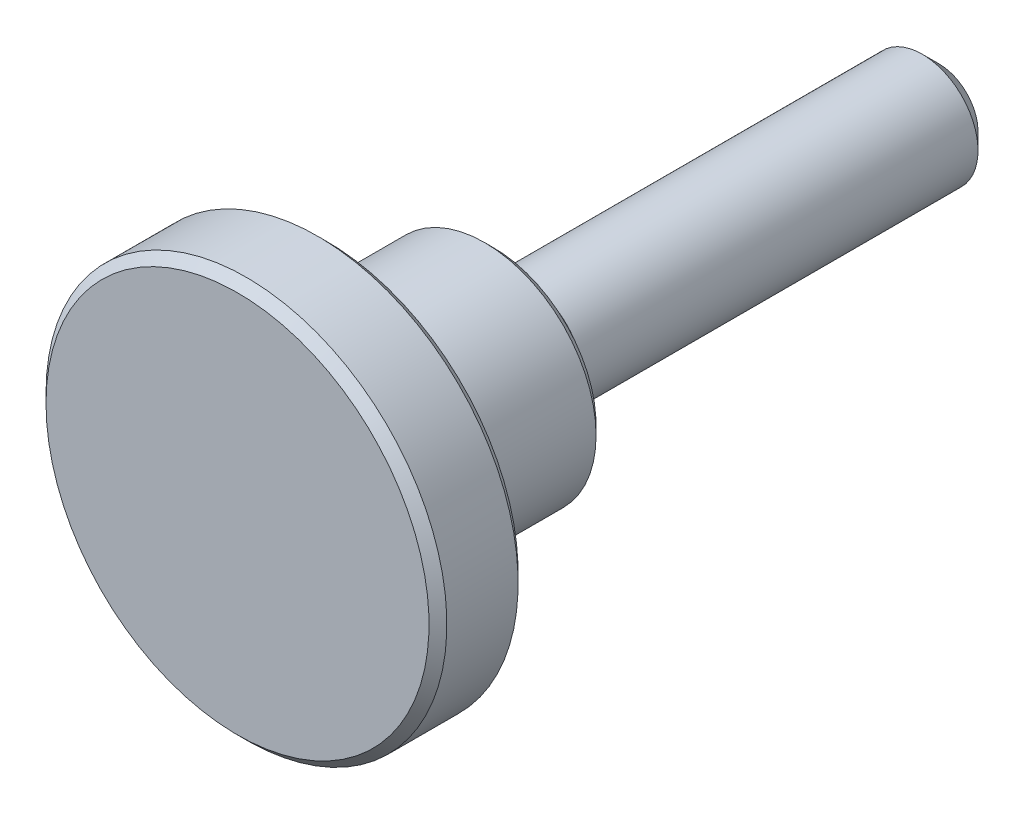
ISO-10303-21;
HEADER;
FILE_DESCRIPTION(('STEP AP214'),'2;1');
FILE_NAME('part.step','',(''),(''),'','','');
FILE_SCHEMA(('AUTOMOTIVE_DESIGN { 1 0 10303 214 1 1 1 1 }'));
ENDSEC;
DATA;
#1=APPLICATION_CONTEXT('core data for automotive mechanical design processes');
#2=APPLICATION_PROTOCOL_DEFINITION('international standard','automotive_design',2000,#1);
#3=PRODUCT_CONTEXT('',#1,'mechanical');
#4=PRODUCT('Part','Part','',(#3));
#5=PRODUCT_RELATED_PRODUCT_CATEGORY('part','',(#4));
#6=PRODUCT_DEFINITION_FORMATION('','',#4);
#7=PRODUCT_DEFINITION_CONTEXT('part definition',#1,'design');
#8=PRODUCT_DEFINITION('design','',#6,#7);
#9=PRODUCT_DEFINITION_SHAPE('','',#8);
#10=(LENGTH_UNIT() NAMED_UNIT(*) SI_UNIT(.MILLI.,.METRE.));
#11=(NAMED_UNIT(*) PLANE_ANGLE_UNIT() SI_UNIT($,.RADIAN.));
#12=(NAMED_UNIT(*) SI_UNIT($,.STERADIAN.) SOLID_ANGLE_UNIT());
#13=UNCERTAINTY_MEASURE_WITH_UNIT(LENGTH_MEASURE(1.E-05),#10,'distance_accuracy_value','');
#14=(GEOMETRIC_REPRESENTATION_CONTEXT(3) GLOBAL_UNCERTAINTY_ASSIGNED_CONTEXT((#13)) GLOBAL_UNIT_ASSIGNED_CONTEXT((#10,
#11,#12)) REPRESENTATION_CONTEXT('',''));
#15=CARTESIAN_POINT('',(0.,0.,0.));
#16=DIRECTION('',(0.,0.,1.));
#17=DIRECTION('',(1.,0.,0.));
#18=AXIS2_PLACEMENT_3D('',#15,#16,#17);
#19=CARTESIAN_POINT('',(0.,0.,-40.));
#20=DIRECTION('',(0.,0.,-1.));
#21=DIRECTION('',(-1.,0.,0.));
#22=AXIS2_PLACEMENT_3D('',#19,#20,#21);
#23=CYLINDRICAL_SURFACE('',#22,5.);
#24=CARTESIAN_POINT('',(0.,0.,-38.5));
#25=DIRECTION('',(0.,0.,-1.));
#26=DIRECTION('',(-1.,0.,0.));
#27=AXIS2_PLACEMENT_3D('',#24,#25,#26);
#28=CIRCLE('',#27,5.);
#29=CARTESIAN_POINT('',(-5.,0.,-38.5));
#30=VERTEX_POINT('',#29);
#31=EDGE_CURVE('E8',#30,#30,#28,.F.);
#32=ORIENTED_EDGE('',*,*,#31,.T.);
#33=EDGE_LOOP('',(#32));
#34=FACE_BOUND('',#33,.T.);
#35=CARTESIAN_POINT('',(0.,0.,-3.));
#36=DIRECTION('',(0.,0.,-1.));
#37=DIRECTION('',(-1.,0.,0.));
#38=AXIS2_PLACEMENT_3D('',#35,#36,#37);
#39=CIRCLE('',#38,5.);
#40=CARTESIAN_POINT('',(-5.,0.,-3.));
#41=VERTEX_POINT('',#40);
#42=EDGE_CURVE('E23',#41,#41,#39,.T.);
#43=ORIENTED_EDGE('',*,*,#42,.T.);
#44=EDGE_LOOP('',(#43));
#45=FACE_BOUND('',#44,.T.);
#46=ADVANCED_FACE('F12',(#34,#45),#23,.T.);
#47=CARTESIAN_POINT('',(0.,5.,-3.));
#48=DIRECTION('',(0.,0.,1.));
#49=DIRECTION('',(1.,0.,0.));
#50=AXIS2_PLACEMENT_3D('',#47,#48,#49);
#51=PLANE('',#50);
#52=CARTESIAN_POINT('',(0.,0.,-3.));
#53=DIRECTION('',(0.,0.,-1.));
#54=DIRECTION('',(-1.,0.,0.));
#55=AXIS2_PLACEMENT_3D('',#52,#53,#54);
#56=CIRCLE('',#55,4.65);
#57=CARTESIAN_POINT('',(-4.65,0.,-3.));
#58=VERTEX_POINT('',#57);
#59=EDGE_CURVE('E27',#58,#58,#56,.T.);
#60=ORIENTED_EDGE('',*,*,#59,.T.);
#61=EDGE_LOOP('',(#60));
#62=FACE_BOUND('',#61,.T.);
#63=ORIENTED_EDGE('',*,*,#42,.F.);
#64=EDGE_LOOP('',(#63));
#65=FACE_BOUND('',#64,.T.);
#66=ADVANCED_FACE('F83',(#62,#65),#51,.T.);
#67=CARTESIAN_POINT('',(0.,0.,-2.2));
#68=DIRECTION('',(0.,0.,-1.));
#69=DIRECTION('',(-1.,0.,0.));
#70=AXIS2_PLACEMENT_3D('',#67,#68,#69);
#71=TOROIDAL_SURFACE('',#70,4.65,0.8);
#72=CARTESIAN_POINT('',(0.,0.,-2.2));
#73=DIRECTION('',(0.,0.,-1.));
#74=DIRECTION('',(-1.,0.,0.));
#75=AXIS2_PLACEMENT_3D('',#72,#73,#74);
#76=CIRCLE('',#75,3.85);
#77=CARTESIAN_POINT('',(-3.85,0.,-2.2));
#78=VERTEX_POINT('',#77);
#79=EDGE_CURVE('E32',#78,#78,#76,.T.);
#80=ORIENTED_EDGE('',*,*,#79,.T.);
#81=EDGE_LOOP('',(#80));
#82=FACE_BOUND('',#81,.T.);
#83=ORIENTED_EDGE('',*,*,#59,.F.);
#84=EDGE_LOOP('',(#83));
#85=FACE_BOUND('',#84,.T.);
#86=ADVANCED_FACE('F88',(#82,#85),#71,.F.);
#87=CARTESIAN_POINT('',(0.,0.,-40.));
#88=DIRECTION('',(0.,0.,-1.));
#89=DIRECTION('',(-1.,0.,0.));
#90=AXIS2_PLACEMENT_3D('',#87,#88,#89);
#91=CYLINDRICAL_SURFACE('',#90,3.85);
#92=CARTESIAN_POINT('',(0.,0.,-0.800000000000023));
#93=DIRECTION('',(0.,0.,-1.));
#94=DIRECTION('',(-1.,0.,0.));
#95=AXIS2_PLACEMENT_3D('',#92,#93,#94);
#96=CIRCLE('',#95,3.85);
#97=CARTESIAN_POINT('',(-3.85,0.,-0.800000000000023));
#98=VERTEX_POINT('',#97);
#99=EDGE_CURVE('E35',#98,#98,#96,.T.);
#100=ORIENTED_EDGE('',*,*,#99,.T.);
#101=EDGE_LOOP('',(#100));
#102=FACE_BOUND('',#101,.T.);
#103=ORIENTED_EDGE('',*,*,#79,.F.);
#104=EDGE_LOOP('',(#103));
#105=FACE_BOUND('',#104,.T.);
#106=ADVANCED_FACE('F95',(#102,#105),#91,.T.);
#107=CARTESIAN_POINT('',(0.,0.,-0.800000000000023));
#108=DIRECTION('',(0.,0.,-1.));
#109=DIRECTION('',(-1.,0.,0.));
#110=AXIS2_PLACEMENT_3D('',#107,#108,#109);
#111=TOROIDAL_SURFACE('',#110,4.65,0.800000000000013);
#112=CARTESIAN_POINT('',(0.,0.,0.));
#113=DIRECTION('',(0.,0.,-1.));
#114=DIRECTION('',(-1.,0.,0.));
#115=AXIS2_PLACEMENT_3D('',#112,#113,#114);
#116=CIRCLE('',#115,4.65000000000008);
#117=CARTESIAN_POINT('',(-4.65000000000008,0.,0.));
#118=VERTEX_POINT('',#117);
#119=EDGE_CURVE('E38',#118,#118,#116,.T.);
#120=ORIENTED_EDGE('',*,*,#119,.T.);
#121=EDGE_LOOP('',(#120));
#122=FACE_BOUND('',#121,.T.);
#123=ORIENTED_EDGE('',*,*,#99,.F.);
#124=EDGE_LOOP('',(#123));
#125=FACE_BOUND('',#124,.T.);
#126=ADVANCED_FACE('F99',(#122,#125),#111,.F.);
#127=CARTESIAN_POINT('',(0.,9.2,0.));
#128=DIRECTION('',(0.,0.,-1.));
#129=DIRECTION('',(-1.,0.,0.));
#130=AXIS2_PLACEMENT_3D('',#127,#128,#129);
#131=PLANE('',#130);
#132=CARTESIAN_POINT('',(0.,0.,0.));
#133=DIRECTION('',(0.,0.,-1.));
#134=DIRECTION('',(-1.,0.,0.));
#135=AXIS2_PLACEMENT_3D('',#132,#133,#134);
#136=CIRCLE('',#135,9.2);
#137=CARTESIAN_POINT('',(-9.2,0.,0.));
#138=VERTEX_POINT('',#137);
#139=EDGE_CURVE('E41',#138,#138,#136,.T.);
#140=ORIENTED_EDGE('',*,*,#139,.T.);
#141=EDGE_LOOP('',(#140));
#142=FACE_BOUND('',#141,.T.);
#143=ORIENTED_EDGE('',*,*,#119,.F.);
#144=EDGE_LOOP('',(#143));
#145=FACE_BOUND('',#144,.T.);
#146=ADVANCED_FACE('F103',(#142,#145),#131,.T.);
#147=CARTESIAN_POINT('',(0.,0.,0.));
#148=DIRECTION('',(0.,0.,1.));
#149=DIRECTION('',(1.,0.,0.));
#150=AXIS2_PLACEMENT_3D('',#147,#148,#149);
#151=CONICAL_SURFACE('',#150,9.2,0.785398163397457);
#152=CARTESIAN_POINT('',(0.,0.,0.8));
#153=DIRECTION('',(0.,0.,-1.));
#154=DIRECTION('',(-1.,0.,0.));
#155=AXIS2_PLACEMENT_3D('',#152,#153,#154);
#156=CIRCLE('',#155,10.);
#157=CARTESIAN_POINT('',(-10.,0.,0.8));
#158=VERTEX_POINT('',#157);
#159=EDGE_CURVE('E44',#158,#158,#156,.T.);
#160=ORIENTED_EDGE('',*,*,#159,.T.);
#161=EDGE_LOOP('',(#160));
#162=FACE_BOUND('',#161,.T.);
#163=ORIENTED_EDGE('',*,*,#139,.F.);
#164=EDGE_LOOP('',(#163));
#165=FACE_BOUND('',#164,.T.);
#166=ADVANCED_FACE('F107',(#162,#165),#151,.T.);
#167=CARTESIAN_POINT('',(0.,0.,-40.));
#168=DIRECTION('',(0.,0.,-1.));
#169=DIRECTION('',(-1.,0.,0.));
#170=AXIS2_PLACEMENT_3D('',#167,#168,#169);
#171=CYLINDRICAL_SURFACE('',#170,10.);
#172=CARTESIAN_POINT('',(0.,0.,13.));
#173=DIRECTION('',(0.,0.,-1.));
#174=DIRECTION('',(-1.,0.,0.));
#175=AXIS2_PLACEMENT_3D('',#172,#173,#174);
#176=CIRCLE('',#175,10.);
#177=CARTESIAN_POINT('',(-10.,0.,13.));
#178=VERTEX_POINT('',#177);
#179=EDGE_CURVE('E47',#178,#178,#176,.T.);
#180=ORIENTED_EDGE('',*,*,#179,.T.);
#181=EDGE_LOOP('',(#180));
#182=FACE_BOUND('',#181,.T.);
#183=ORIENTED_EDGE('',*,*,#159,.F.);
#184=EDGE_LOOP('',(#183));
#185=FACE_BOUND('',#184,.T.);
#186=ADVANCED_FACE('F111',(#182,#185),#171,.T.);
#187=CARTESIAN_POINT('',(0.,0.,13.));
#188=DIRECTION('',(0.,0.,-1.));
#189=DIRECTION('',(-1.,0.,0.));
#190=AXIS2_PLACEMENT_3D('',#187,#188,#189);
#191=TOROIDAL_SURFACE('',#190,12.,2.);
#192=CARTESIAN_POINT('',(0.,0.,15.));
#193=DIRECTION('',(0.,0.,-1.));
#194=DIRECTION('',(-1.,0.,0.));
#195=AXIS2_PLACEMENT_3D('',#192,#193,#194);
#196=CIRCLE('',#195,12.);
#197=CARTESIAN_POINT('',(-12.,0.,15.));
#198=VERTEX_POINT('',#197);
#199=EDGE_CURVE('E50',#198,#198,#196,.T.);
#200=ORIENTED_EDGE('',*,*,#199,.T.);
#201=EDGE_LOOP('',(#200));
#202=FACE_BOUND('',#201,.T.);
#203=ORIENTED_EDGE('',*,*,#179,.F.);
#204=EDGE_LOOP('',(#203));
#205=FACE_BOUND('',#204,.T.);
#206=ADVANCED_FACE('F115',(#202,#205),#191,.F.);
#207=CARTESIAN_POINT('',(0.,17.2,15.));
#208=DIRECTION('',(0.,0.,-1.));
#209=DIRECTION('',(-1.,0.,0.));
#210=AXIS2_PLACEMENT_3D('',#207,#208,#209);
#211=PLANE('',#210);
#212=CARTESIAN_POINT('',(0.,0.,15.));
#213=DIRECTION('',(0.,0.,-1.));
#214=DIRECTION('',(-1.,0.,0.));
#215=AXIS2_PLACEMENT_3D('',#212,#213,#214);
#216=CIRCLE('',#215,17.2);
#217=CARTESIAN_POINT('',(-17.2,0.,15.));
#218=VERTEX_POINT('',#217);
#219=EDGE_CURVE('E53',#218,#218,#216,.T.);
#220=ORIENTED_EDGE('',*,*,#219,.T.);
#221=EDGE_LOOP('',(#220));
#222=FACE_BOUND('',#221,.T.);
#223=ORIENTED_EDGE('',*,*,#199,.F.);
#224=EDGE_LOOP('',(#223));
#225=FACE_BOUND('',#224,.T.);
#226=ADVANCED_FACE('F119',(#222,#225),#211,.T.);
#227=CARTESIAN_POINT('',(0.,0.,15.));
#228=DIRECTION('',(0.,0.,1.));
#229=DIRECTION('',(1.,0.,0.));
#230=AXIS2_PLACEMENT_3D('',#227,#228,#229);
#231=CONICAL_SURFACE('',#230,17.2,0.785398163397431);
#232=CARTESIAN_POINT('',(0.,0.,15.8));
#233=DIRECTION('',(0.,0.,-1.));
#234=DIRECTION('',(-1.,0.,0.));
#235=AXIS2_PLACEMENT_3D('',#232,#233,#234);
#236=CIRCLE('',#235,18.);
#237=CARTESIAN_POINT('',(-18.,0.,15.8));
#238=VERTEX_POINT('',#237);
#239=EDGE_CURVE('E56',#238,#238,#236,.T.);
#240=ORIENTED_EDGE('',*,*,#239,.T.);
#241=EDGE_LOOP('',(#240));
#242=FACE_BOUND('',#241,.T.);
#243=ORIENTED_EDGE('',*,*,#219,.F.);
#244=EDGE_LOOP('',(#243));
#245=FACE_BOUND('',#244,.T.);
#246=ADVANCED_FACE('F123',(#242,#245),#231,.T.);
#247=CARTESIAN_POINT('',(0.,0.,-40.));
#248=DIRECTION('',(0.,0.,-1.));
#249=DIRECTION('',(-1.,0.,0.));
#250=AXIS2_PLACEMENT_3D('',#247,#248,#249);
#251=CYLINDRICAL_SURFACE('',#250,18.);
#252=CARTESIAN_POINT('',(0.,0.,22.2));
#253=DIRECTION('',(0.,0.,-1.));
#254=DIRECTION('',(-1.,0.,0.));
#255=AXIS2_PLACEMENT_3D('',#252,#253,#254);
#256=CIRCLE('',#255,18.);
#257=CARTESIAN_POINT('',(-18.,0.,22.2));
#258=VERTEX_POINT('',#257);
#259=EDGE_CURVE('E59',#258,#258,#256,.T.);
#260=ORIENTED_EDGE('',*,*,#259,.T.);
#261=EDGE_LOOP('',(#260));
#262=FACE_BOUND('',#261,.T.);
#263=ORIENTED_EDGE('',*,*,#239,.F.);
#264=EDGE_LOOP('',(#263));
#265=FACE_BOUND('',#264,.T.);
#266=ADVANCED_FACE('F80',(#262,#265),#251,.T.);
#267=CARTESIAN_POINT('',(0.,0.,22.2));
#268=DIRECTION('',(0.,0.,-1.));
#269=DIRECTION('',(-1.,0.,0.));
#270=AXIS2_PLACEMENT_3D('',#267,#268,#269);
#271=CONICAL_SURFACE('',#270,18.,0.785398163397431);
#272=CARTESIAN_POINT('',(0.,0.,23.));
#273=DIRECTION('',(0.,0.,-1.));
#274=DIRECTION('',(-1.,0.,0.));
#275=AXIS2_PLACEMENT_3D('',#272,#273,#274);
#276=CIRCLE('',#275,17.2);
#277=CARTESIAN_POINT('',(-17.2,0.,23.));
#278=VERTEX_POINT('',#277);
#279=EDGE_CURVE('E62',#278,#278,#276,.T.);
#280=ORIENTED_EDGE('',*,*,#279,.T.);
#281=EDGE_LOOP('',(#280));
#282=FACE_BOUND('',#281,.T.);
#283=ORIENTED_EDGE('',*,*,#259,.F.);
#284=EDGE_LOOP('',(#283));
#285=FACE_BOUND('',#284,.T.);
#286=ADVANCED_FACE('F66',(#282,#285),#271,.T.);
#287=CARTESIAN_POINT('',(0.,17.2,23.));
#288=DIRECTION('',(0.,0.,1.));
#289=DIRECTION('',(1.,0.,0.));
#290=AXIS2_PLACEMENT_3D('',#287,#288,#289);
#291=PLANE('',#290);
#292=ORIENTED_EDGE('',*,*,#279,.F.);
#293=EDGE_LOOP('',(#292));
#294=FACE_BOUND('',#293,.T.);
#295=ADVANCED_FACE('F69',(#294),#291,.T.);
#296=CARTESIAN_POINT('',(0.,0.,-40.));
#297=DIRECTION('',(0.,0.,-1.));
#298=DIRECTION('',(-1.,0.,0.));
#299=AXIS2_PLACEMENT_3D('',#296,#297,#298);
#300=PLANE('',#299);
#301=CARTESIAN_POINT('',(0.,0.,-40.));
#302=DIRECTION('',(0.,0.,-1.));
#303=DIRECTION('',(-1.,0.,0.));
#304=AXIS2_PLACEMENT_3D('',#301,#302,#303);
#305=CIRCLE('',#304,3.5);
#306=CARTESIAN_POINT('',(-3.5,0.,-40.));
#307=VERTEX_POINT('',#306);
#308=EDGE_CURVE('E19',#307,#307,#305,.T.);
#309=ORIENTED_EDGE('',*,*,#308,.T.);
#310=EDGE_LOOP('',(#309));
#311=FACE_BOUND('',#310,.T.);
#312=ADVANCED_FACE('F71',(#311),#300,.T.);
#313=CARTESIAN_POINT('',(0.,0.,-40.));
#314=DIRECTION('',(0.,0.,1.));
#315=DIRECTION('',(1.,0.,0.));
#316=AXIS2_PLACEMENT_3D('',#313,#314,#315);
#317=CONICAL_SURFACE('',#316,3.5,0.785398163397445);
#318=ORIENTED_EDGE('',*,*,#31,.F.);
#319=EDGE_LOOP('',(#318));
#320=FACE_BOUND('',#319,.T.);
#321=ORIENTED_EDGE('',*,*,#308,.F.);
#322=EDGE_LOOP('',(#321));
#323=FACE_BOUND('',#322,.T.);
#324=ADVANCED_FACE('F14',(#320,#323),#317,.T.);
#325=CLOSED_SHELL('',(#46,#66,#86,#106,#126,#146,#166,#186,#206,#226,#246,#266,#286,#295,#312,#324));
#326=MANIFOLD_SOLID_BREP('B1',#325);
#327=ADVANCED_BREP_SHAPE_REPRESENTATION('',(#18,#326),#14);
#328=SHAPE_DEFINITION_REPRESENTATION(#9,#327);
ENDSEC;
END-ISO-10303-21;
